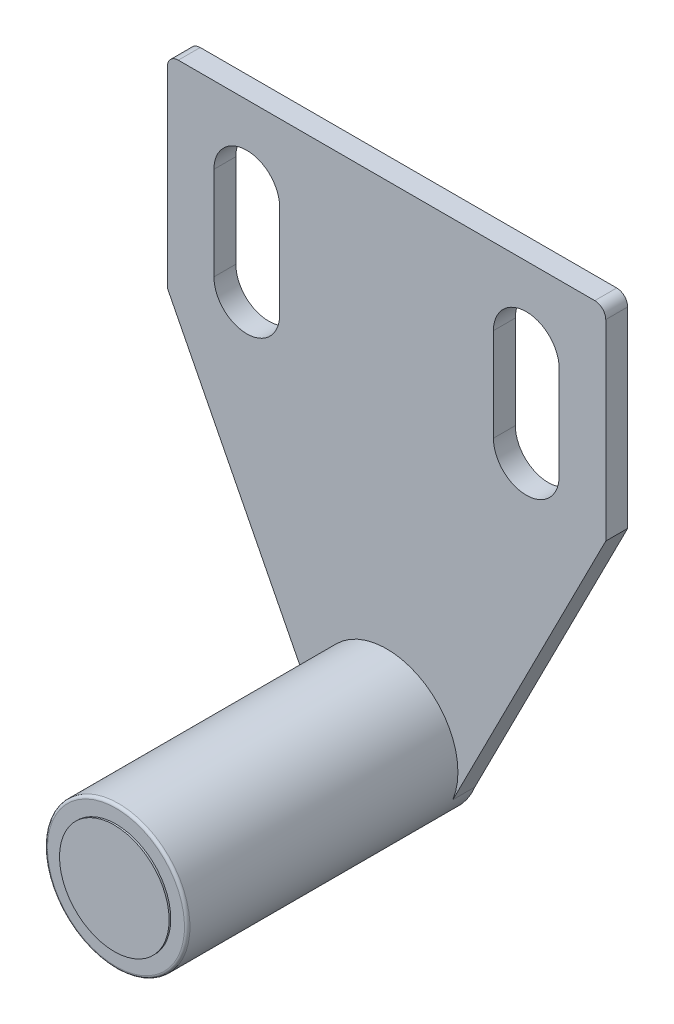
ISO-10303-21;
HEADER;
FILE_DESCRIPTION(('STEP AP214'),'2;1');
FILE_NAME('part.step','',(''),(''),'','','');
FILE_SCHEMA(('AUTOMOTIVE_DESIGN { 1 0 10303 214 1 1 1 1 }'));
ENDSEC;
DATA;
#1=APPLICATION_CONTEXT('core data for automotive mechanical design processes');
#2=APPLICATION_PROTOCOL_DEFINITION('international standard','automotive_design',2000,#1);
#3=PRODUCT_CONTEXT('',#1,'mechanical');
#4=PRODUCT('Part','Part','',(#3));
#5=PRODUCT_RELATED_PRODUCT_CATEGORY('part','',(#4));
#6=PRODUCT_DEFINITION_FORMATION('','',#4);
#7=PRODUCT_DEFINITION_CONTEXT('part definition',#1,'design');
#8=PRODUCT_DEFINITION('design','',#6,#7);
#9=PRODUCT_DEFINITION_SHAPE('','',#8);
#10=(LENGTH_UNIT() NAMED_UNIT(*) SI_UNIT(.MILLI.,.METRE.));
#11=(NAMED_UNIT(*) PLANE_ANGLE_UNIT() SI_UNIT($,.RADIAN.));
#12=(NAMED_UNIT(*) SI_UNIT($,.STERADIAN.) SOLID_ANGLE_UNIT());
#13=UNCERTAINTY_MEASURE_WITH_UNIT(LENGTH_MEASURE(1.E-05),#10,'distance_accuracy_value','');
#14=(GEOMETRIC_REPRESENTATION_CONTEXT(3) GLOBAL_UNCERTAINTY_ASSIGNED_CONTEXT((#13)) GLOBAL_UNIT_ASSIGNED_CONTEXT((#10,
#11,#12)) REPRESENTATION_CONTEXT('',''));
#15=CARTESIAN_POINT('',(0.,0.,0.));
#16=DIRECTION('',(0.,0.,1.));
#17=DIRECTION('',(1.,0.,0.));
#18=AXIS2_PLACEMENT_3D('',#15,#16,#17);
#19=CARTESIAN_POINT('',(0.0120447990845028,-28.5056632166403,26.45));
#20=DIRECTION('',(0.,0.,1.));
#21=DIRECTION('',(1.,0.,0.));
#22=AXIS2_PLACEMENT_3D('',#19,#20,#21);
#23=TOROIDAL_SURFACE('',#22,6.25,0.25);
#24=CARTESIAN_POINT('',(0.0120447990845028,-28.5056632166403,26.7));
#25=DIRECTION('',(0.,0.,-1.));
#26=DIRECTION('',(0.891317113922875,0.453380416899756,0.));
#27=AXIS2_PLACEMENT_3D('',#24,#25,#26);
#28=CIRCLE('',#27,6.25);
#29=CARTESIAN_POINT('',(-5.55868716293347,-31.3392908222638,26.7));
#30=VERTEX_POINT('',#29);
#31=CARTESIAN_POINT('',(-6.2379552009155,-28.5056632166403,26.7));
#32=VERTEX_POINT('',#31);
#33=EDGE_CURVE('E10',#30,#32,#28,.T.);
#34=ORIENTED_EDGE('',*,*,#33,.T.);
#35=CARTESIAN_POINT('',(-6.2379552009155,-28.5056632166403,26.45));
#36=DIRECTION('',(0.,-1.,0.));
#37=DIRECTION('',(-1.,0.,0.));
#38=AXIS2_PLACEMENT_3D('',#35,#36,#37);
#39=CIRCLE('',#38,0.25);
#40=CARTESIAN_POINT('',(-6.4879552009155,-28.5056632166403,26.45));
#41=VERTEX_POINT('',#40);
#42=EDGE_CURVE('E27',#32,#41,#39,.T.);
#43=ORIENTED_EDGE('',*,*,#42,.T.);
#44=CARTESIAN_POINT('',(0.0120447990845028,-28.5056632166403,26.45));
#45=DIRECTION('',(0.,0.,1.));
#46=DIRECTION('',(0.891317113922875,0.453380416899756,0.));
#47=AXIS2_PLACEMENT_3D('',#44,#45,#46);
#48=CIRCLE('',#47,6.5);
#49=CARTESIAN_POINT('',(-5.78151644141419,-31.4526359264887,26.45));
#50=VERTEX_POINT('',#49);
#51=EDGE_CURVE('E300',#41,#50,#48,.T.);
#52=ORIENTED_EDGE('',*,*,#51,.T.);
#53=CARTESIAN_POINT('',(0.0120447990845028,-28.5056632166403,26.45));
#54=DIRECTION('',(0.,0.,1.));
#55=DIRECTION('',(0.891317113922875,0.453380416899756,0.));
#56=AXIS2_PLACEMENT_3D('',#53,#54,#55);
#57=CIRCLE('',#56,6.5);
#58=EDGE_CURVE('E275',#50,#41,#57,.T.);
#59=ORIENTED_EDGE('',*,*,#58,.T.);
#60=ORIENTED_EDGE('',*,*,#42,.F.);
#61=CARTESIAN_POINT('',(0.0120447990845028,-28.5056632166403,26.7));
#62=DIRECTION('',(0.,0.,-1.));
#63=DIRECTION('',(0.891317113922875,0.453380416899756,0.));
#64=AXIS2_PLACEMENT_3D('',#61,#62,#63);
#65=CIRCLE('',#64,6.25);
#66=EDGE_CURVE('E246',#32,#30,#65,.T.);
#67=ORIENTED_EDGE('',*,*,#66,.T.);
#68=EDGE_LOOP('',(#34,#43,#52,#59,#60,#67));
#69=FACE_BOUND('',#68,.T.);
#70=ADVANCED_FACE('F16',(#69),#23,.T.);
#71=CARTESIAN_POINT('',(0.012044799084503,-28.5056632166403,26.7));
#72=DIRECTION('',(0.,0.,1.));
#73=DIRECTION('',(1.,0.,0.));
#74=AXIS2_PLACEMENT_3D('',#71,#72,#73);
#75=PLANE('',#74);
#76=ORIENTED_EDGE('',*,*,#33,.F.);
#77=ORIENTED_EDGE('',*,*,#66,.F.);
#78=EDGE_LOOP('',(#76,#77));
#79=FACE_BOUND('',#78,.T.);
#80=CARTESIAN_POINT('',(0.0120447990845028,-28.5056632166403,26.7));
#81=DIRECTION('',(0.,0.,-1.));
#82=DIRECTION('',(1.,0.,0.));
#83=AXIS2_PLACEMENT_3D('',#80,#81,#82);
#84=CIRCLE('',#83,5.);
#85=CARTESIAN_POINT('',(5.0120447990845,-28.5056632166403,26.7));
#86=VERTEX_POINT('',#85);
#87=CARTESIAN_POINT('',(-4.9879552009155,-28.5056632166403,26.7));
#88=VERTEX_POINT('',#87);
#89=EDGE_CURVE('E243',#86,#88,#84,.T.);
#90=ORIENTED_EDGE('',*,*,#89,.T.);
#91=CARTESIAN_POINT('',(0.0120447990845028,-28.5056632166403,26.7));
#92=DIRECTION('',(0.,0.,-1.));
#93=DIRECTION('',(1.,0.,0.));
#94=AXIS2_PLACEMENT_3D('',#91,#92,#93);
#95=CIRCLE('',#94,5.);
#96=EDGE_CURVE('E247',#88,#86,#95,.T.);
#97=ORIENTED_EDGE('',*,*,#96,.T.);
#98=EDGE_LOOP('',(#90,#97));
#99=FACE_BOUND('',#98,.T.);
#100=ADVANCED_FACE('F701',(#79,#99),#75,.T.);
#101=CARTESIAN_POINT('',(0.0120447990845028,-28.5056632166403,0.));
#102=DIRECTION('',(0.,0.,1.));
#103=DIRECTION('',(0.891317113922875,0.453380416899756,0.));
#104=AXIS2_PLACEMENT_3D('',#101,#102,#103);
#105=CYLINDRICAL_SURFACE('',#104,6.5);
#106=ORIENTED_EDGE('',*,*,#58,.F.);
#107=DIRECTION('',(0.,0.,-1.));
#108=VECTOR('',#107,1.);
#109=CARTESIAN_POINT('',(-5.78151644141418,-31.4526359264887,0.));
#110=LINE('',#109,#108);
#111=CARTESIAN_POINT('',(-5.78151644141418,-31.4526359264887,2.));
#112=VERTEX_POINT('',#111);
#113=EDGE_CURVE('E310',#50,#112,#110,.T.);
#114=ORIENTED_EDGE('',*,*,#113,.T.);
#115=DIRECTION('',(0.,0.,1.));
#116=VECTOR('',#115,1.);
#117=CARTESIAN_POINT('',(-5.78151644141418,-31.4526359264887,0.));
#118=LINE('',#117,#116);
#119=CARTESIAN_POINT('',(-5.78151644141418,-31.4526359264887,0.));
#120=VERTEX_POINT('',#119);
#121=EDGE_CURVE('E268',#120,#112,#118,.T.);
#122=ORIENTED_EDGE('',*,*,#121,.F.);
#123=CARTESIAN_POINT('',(0.0120447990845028,-28.5056632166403,0.));
#124=DIRECTION('',(0.,0.,-1.));
#125=DIRECTION('',(0.891317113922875,0.453380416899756,0.));
#126=AXIS2_PLACEMENT_3D('',#123,#124,#125);
#127=CIRCLE('',#126,6.5);
#128=CARTESIAN_POINT('',(6.04810799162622,-30.9172894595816,0.));
#129=VERTEX_POINT('',#128);
#130=EDGE_CURVE('E286',#129,#120,#127,.T.);
#131=ORIENTED_EDGE('',*,*,#130,.F.);
#132=DIRECTION('',(0.,0.,1.));
#133=VECTOR('',#132,1.);
#134=CARTESIAN_POINT('',(6.04810799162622,-30.9172894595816,0.));
#135=LINE('',#134,#133);
#136=CARTESIAN_POINT('',(6.04810799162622,-30.9172894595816,2.));
#137=VERTEX_POINT('',#136);
#138=EDGE_CURVE('E263',#129,#137,#135,.T.);
#139=ORIENTED_EDGE('',*,*,#138,.T.);
#140=CARTESIAN_POINT('',(0.0120447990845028,-28.5056632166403,2.));
#141=DIRECTION('',(0.,0.,-1.));
#142=DIRECTION('',(-0.891317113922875,-0.453380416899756,0.));
#143=AXIS2_PLACEMENT_3D('',#140,#141,#142);
#144=CIRCLE('',#143,6.5);
#145=EDGE_CURVE('E281',#112,#137,#144,.T.);
#146=ORIENTED_EDGE('',*,*,#145,.F.);
#147=ORIENTED_EDGE('',*,*,#113,.F.);
#148=ORIENTED_EDGE('',*,*,#51,.F.);
#149=EDGE_LOOP('',(#106,#114,#122,#131,#139,#146,#147,#148));
#150=FACE_BOUND('',#149,.T.);
#151=ADVANCED_FACE('F642',(#150),#105,.T.);
#152=CARTESIAN_POINT('',(0.0120447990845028,-28.5056632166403,26.7));
#153=DIRECTION('',(0.,0.,1.));
#154=DIRECTION('',(1.,0.,0.));
#155=AXIS2_PLACEMENT_3D('',#152,#153,#154);
#156=CYLINDRICAL_SURFACE('',#155,5.);
#157=CARTESIAN_POINT('',(0.0120447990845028,-28.5056632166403,26.85));
#158=DIRECTION('',(0.,0.,1.));
#159=DIRECTION('',(1.,0.,0.));
#160=AXIS2_PLACEMENT_3D('',#157,#158,#159);
#161=CIRCLE('',#160,5.);
#162=CARTESIAN_POINT('',(5.0120447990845,-28.5056632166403,26.85));
#163=VERTEX_POINT('',#162);
#164=CARTESIAN_POINT('',(-4.9879552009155,-28.5056632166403,26.85));
#165=VERTEX_POINT('',#164);
#166=EDGE_CURVE('E264',#163,#165,#161,.T.);
#167=ORIENTED_EDGE('',*,*,#166,.F.);
#168=CARTESIAN_POINT('',(0.0120447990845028,-28.5056632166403,26.85));
#169=DIRECTION('',(0.,0.,1.));
#170=DIRECTION('',(1.,0.,0.));
#171=AXIS2_PLACEMENT_3D('',#168,#169,#170);
#172=CIRCLE('',#171,5.);
#173=EDGE_CURVE('E283',#165,#163,#172,.T.);
#174=ORIENTED_EDGE('',*,*,#173,.F.);
#175=DIRECTION('',(0.,0.,-1.));
#176=VECTOR('',#175,1.);
#177=CARTESIAN_POINT('',(-4.9879552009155,-28.5056632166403,26.7));
#178=LINE('',#177,#176);
#179=EDGE_CURVE('E259',#165,#88,#178,.T.);
#180=ORIENTED_EDGE('',*,*,#179,.T.);
#181=ORIENTED_EDGE('',*,*,#89,.F.);
#182=ORIENTED_EDGE('',*,*,#96,.F.);
#183=ORIENTED_EDGE('',*,*,#179,.F.);
#184=EDGE_LOOP('',(#167,#174,#180,#181,#182,#183));
#185=FACE_BOUND('',#184,.T.);
#186=ADVANCED_FACE('F707',(#185),#156,.T.);
#187=CARTESIAN_POINT('',(0.012044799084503,-28.5056632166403,26.85));
#188=DIRECTION('',(0.,0.,1.));
#189=DIRECTION('',(1.,0.,0.));
#190=AXIS2_PLACEMENT_3D('',#187,#188,#189);
#191=PLANE('',#190);
#192=ORIENTED_EDGE('',*,*,#166,.T.);
#193=ORIENTED_EDGE('',*,*,#173,.T.);
#194=EDGE_LOOP('',(#192,#193));
#195=FACE_BOUND('',#194,.T.);
#196=ADVANCED_FACE('F709',(#195),#191,.T.);
#197=CARTESIAN_POINT('',(-0.000749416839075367,-4.95028168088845,2.));
#198=DIRECTION('',(0.,0.,1.));
#199=DIRECTION('',(1.,0.,0.));
#200=AXIS2_PLACEMENT_3D('',#197,#198,#199);
#201=PLANE('',#200);
#202=ORIENTED_EDGE('',*,*,#145,.T.);
#203=DIRECTION('',(-0.453528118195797,-0.891241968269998,0.));
#204=VECTOR('',#203,1.);
#205=CARTESIAN_POINT('',(20.,-3.5,2.));
#206=LINE('',#205,#204);
#207=CARTESIAN_POINT('',(20.,-3.5,2.));
#208=VERTEX_POINT('',#207);
#209=EDGE_CURVE('E314',#208,#137,#206,.T.);
#210=ORIENTED_EDGE('',*,*,#209,.F.);
#211=DIRECTION('',(0.,-1.,0.));
#212=VECTOR('',#211,1.);
#213=CARTESIAN_POINT('',(20.,15.,2.));
#214=LINE('',#213,#212);
#215=CARTESIAN_POINT('',(20.,14.,2.));
#216=VERTEX_POINT('',#215);
#217=EDGE_CURVE('E304',#216,#208,#214,.T.);
#218=ORIENTED_EDGE('',*,*,#217,.F.);
#219=CARTESIAN_POINT('',(19.,14.,2.));
#220=DIRECTION('',(0.,0.,-1.));
#221=DIRECTION('',(0.707106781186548,0.707106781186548,0.));
#222=AXIS2_PLACEMENT_3D('',#219,#220,#221);
#223=CIRCLE('',#222,1.);
#224=CARTESIAN_POINT('',(19.,15.,2.));
#225=VERTEX_POINT('',#224);
#226=EDGE_CURVE('E373',#225,#216,#223,.T.);
#227=ORIENTED_EDGE('',*,*,#226,.F.);
#228=DIRECTION('',(1.,0.,0.));
#229=VECTOR('',#228,1.);
#230=CARTESIAN_POINT('',(-20.,15.,2.));
#231=LINE('',#230,#229);
#232=CARTESIAN_POINT('',(-19.,15.,2.));
#233=VERTEX_POINT('',#232);
#234=EDGE_CURVE('E265',#233,#225,#231,.T.);
#235=ORIENTED_EDGE('',*,*,#234,.F.);
#236=CARTESIAN_POINT('',(-19.,14.,2.));
#237=DIRECTION('',(0.,0.,-1.));
#238=DIRECTION('',(-0.707106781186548,0.707106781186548,0.));
#239=AXIS2_PLACEMENT_3D('',#236,#237,#238);
#240=CIRCLE('',#239,1.);
#241=CARTESIAN_POINT('',(-20.,14.,2.));
#242=VERTEX_POINT('',#241);
#243=EDGE_CURVE('E253',#242,#233,#240,.T.);
#244=ORIENTED_EDGE('',*,*,#243,.F.);
#245=DIRECTION('',(0.,1.,0.));
#246=VECTOR('',#245,1.);
#247=CARTESIAN_POINT('',(-20.,-3.5,2.));
#248=LINE('',#247,#246);
#249=CARTESIAN_POINT('',(-20.,-3.5,2.));
#250=VERTEX_POINT('',#249);
#251=EDGE_CURVE('E298',#250,#242,#248,.T.);
#252=ORIENTED_EDGE('',*,*,#251,.F.);
#253=DIRECTION('',(-0.453380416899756,0.891317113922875,0.));
#254=VECTOR('',#253,1.);
#255=CARTESIAN_POINT('',(-5.78151644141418,-31.4526359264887,2.));
#256=LINE('',#255,#254);
#257=EDGE_CURVE('E269',#112,#250,#256,.T.);
#258=ORIENTED_EDGE('',*,*,#257,.F.);
#259=EDGE_LOOP('',(#202,#210,#218,#227,#235,#244,#252,#258));
#260=FACE_BOUND('',#259,.T.);
#261=DIRECTION('',(0.,1.,0.));
#262=VECTOR('',#261,1.);
#263=CARTESIAN_POINT('',(9.75,-2.72514084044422,2.));
#264=LINE('',#263,#262);
#265=CARTESIAN_POINT('',(9.75,-0.5,2.));
#266=VERTEX_POINT('',#265);
#267=CARTESIAN_POINT('',(9.75,8.,2.));
#268=VERTEX_POINT('',#267);
#269=EDGE_CURVE('E284',#266,#268,#264,.T.);
#270=ORIENTED_EDGE('',*,*,#269,.T.);
#271=CARTESIAN_POINT('',(12.75,8.,2.));
#272=DIRECTION('',(0.,0.,-1.));
#273=DIRECTION('',(-1.,0.,0.));
#274=AXIS2_PLACEMENT_3D('',#271,#272,#273);
#275=CIRCLE('',#274,3.);
#276=CARTESIAN_POINT('',(15.75,8.,2.));
#277=VERTEX_POINT('',#276);
#278=EDGE_CURVE('E242',#268,#277,#275,.T.);
#279=ORIENTED_EDGE('',*,*,#278,.T.);
#280=DIRECTION('',(0.,-1.,0.));
#281=VECTOR('',#280,1.);
#282=CARTESIAN_POINT('',(15.75,1.52485915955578,2.));
#283=LINE('',#282,#281);
#284=CARTESIAN_POINT('',(15.75,-0.5,2.));
#285=VERTEX_POINT('',#284);
#286=EDGE_CURVE('E238',#277,#285,#283,.T.);
#287=ORIENTED_EDGE('',*,*,#286,.T.);
#288=CARTESIAN_POINT('',(12.75,-0.5,2.));
#289=DIRECTION('',(0.,0.,-1.));
#290=DIRECTION('',(1.,0.,0.));
#291=AXIS2_PLACEMENT_3D('',#288,#289,#290);
#292=CIRCLE('',#291,3.);
#293=EDGE_CURVE('E216',#285,#266,#292,.T.);
#294=ORIENTED_EDGE('',*,*,#293,.T.);
#295=EDGE_LOOP('',(#270,#279,#287,#294));
#296=FACE_BOUND('',#295,.T.);
#297=DIRECTION('',(0.,1.,0.));
#298=VECTOR('',#297,1.);
#299=CARTESIAN_POINT('',(-15.75,-2.72514084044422,2.));
#300=LINE('',#299,#298);
#301=CARTESIAN_POINT('',(-15.75,-0.5,2.));
#302=VERTEX_POINT('',#301);
#303=CARTESIAN_POINT('',(-15.75,8.,2.));
#304=VERTEX_POINT('',#303);
#305=EDGE_CURVE('E206',#302,#304,#300,.T.);
#306=ORIENTED_EDGE('',*,*,#305,.T.);
#307=CARTESIAN_POINT('',(-12.75,8.,2.));
#308=DIRECTION('',(0.,0.,-1.));
#309=DIRECTION('',(-1.,0.,0.));
#310=AXIS2_PLACEMENT_3D('',#307,#308,#309);
#311=CIRCLE('',#310,3.);
#312=CARTESIAN_POINT('',(-9.75,8.,2.));
#313=VERTEX_POINT('',#312);
#314=EDGE_CURVE('E196',#304,#313,#311,.T.);
#315=ORIENTED_EDGE('',*,*,#314,.T.);
#316=DIRECTION('',(0.,-1.,0.));
#317=VECTOR('',#316,1.);
#318=CARTESIAN_POINT('',(-9.75,1.52485915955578,2.));
#319=LINE('',#318,#317);
#320=CARTESIAN_POINT('',(-9.75,-0.5,2.));
#321=VERTEX_POINT('',#320);
#322=EDGE_CURVE('E207',#313,#321,#319,.T.);
#323=ORIENTED_EDGE('',*,*,#322,.T.);
#324=CARTESIAN_POINT('',(-12.75,-0.5,2.));
#325=DIRECTION('',(0.,0.,-1.));
#326=DIRECTION('',(1.,0.,0.));
#327=AXIS2_PLACEMENT_3D('',#324,#325,#326);
#328=CIRCLE('',#327,3.);
#329=EDGE_CURVE('E211',#321,#302,#328,.T.);
#330=ORIENTED_EDGE('',*,*,#329,.T.);
#331=EDGE_LOOP('',(#306,#315,#323,#330));
#332=FACE_BOUND('',#331,.T.);
#333=ADVANCED_FACE('F210',(#260,#296,#332),#201,.T.);
#334=CARTESIAN_POINT('',(-19.,14.,0.));
#335=DIRECTION('',(0.,0.,1.));
#336=DIRECTION('',(-0.707106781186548,0.707106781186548,0.));
#337=AXIS2_PLACEMENT_3D('',#334,#335,#336);
#338=CYLINDRICAL_SURFACE('',#337,1.);
#339=ORIENTED_EDGE('',*,*,#243,.T.);
#340=DIRECTION('',(0.,0.,-1.));
#341=VECTOR('',#340,1.);
#342=CARTESIAN_POINT('',(-19.,15.,0.));
#343=LINE('',#342,#341);
#344=CARTESIAN_POINT('',(-19.,15.,0.));
#345=VERTEX_POINT('',#344);
#346=EDGE_CURVE('E249',#233,#345,#343,.T.);
#347=ORIENTED_EDGE('',*,*,#346,.T.);
#348=CARTESIAN_POINT('',(-19.,14.,0.));
#349=DIRECTION('',(0.,0.,1.));
#350=DIRECTION('',(-0.707106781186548,0.707106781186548,0.));
#351=AXIS2_PLACEMENT_3D('',#348,#349,#350);
#352=CIRCLE('',#351,1.);
#353=CARTESIAN_POINT('',(-20.,14.,0.));
#354=VERTEX_POINT('',#353);
#355=EDGE_CURVE('E254',#345,#354,#352,.T.);
#356=ORIENTED_EDGE('',*,*,#355,.T.);
#357=DIRECTION('',(0.,0.,1.));
#358=VECTOR('',#357,1.);
#359=CARTESIAN_POINT('',(-20.,14.,0.));
#360=LINE('',#359,#358);
#361=EDGE_CURVE('E255',#354,#242,#360,.T.);
#362=ORIENTED_EDGE('',*,*,#361,.T.);
#363=EDGE_LOOP('',(#339,#347,#356,#362));
#364=FACE_BOUND('',#363,.T.);
#365=ADVANCED_FACE('F717',(#364),#338,.T.);
#366=CARTESIAN_POINT('',(-20.,-3.5,0.));
#367=DIRECTION('',(-1.,0.,0.));
#368=DIRECTION('',(0.,1.,0.));
#369=AXIS2_PLACEMENT_3D('',#366,#367,#368);
#370=PLANE('',#369);
#371=ORIENTED_EDGE('',*,*,#361,.F.);
#372=DIRECTION('',(0.,1.,0.));
#373=VECTOR('',#372,1.);
#374=CARTESIAN_POINT('',(-20.,-3.5,0.));
#375=LINE('',#374,#373);
#376=CARTESIAN_POINT('',(-20.,-3.5,0.));
#377=VERTEX_POINT('',#376);
#378=EDGE_CURVE('E357',#377,#354,#375,.T.);
#379=ORIENTED_EDGE('',*,*,#378,.F.);
#380=DIRECTION('',(0.,0.,1.));
#381=VECTOR('',#380,1.);
#382=CARTESIAN_POINT('',(-20.,-3.5,0.));
#383=LINE('',#382,#381);
#384=EDGE_CURVE('E20',#377,#250,#383,.T.);
#385=ORIENTED_EDGE('',*,*,#384,.T.);
#386=ORIENTED_EDGE('',*,*,#251,.T.);
#387=EDGE_LOOP('',(#371,#379,#385,#386));
#388=FACE_BOUND('',#387,.T.);
#389=ADVANCED_FACE('F746',(#388),#370,.T.);
#390=CARTESIAN_POINT('',(-0.000749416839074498,-4.95028168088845,0.));
#391=DIRECTION('',(0.,0.,1.));
#392=DIRECTION('',(1.,0.,0.));
#393=AXIS2_PLACEMENT_3D('',#390,#391,#392);
#394=PLANE('',#393);
#395=ORIENTED_EDGE('',*,*,#355,.F.);
#396=DIRECTION('',(1.,0.,0.));
#397=VECTOR('',#396,1.);
#398=CARTESIAN_POINT('',(-20.,15.,0.));
#399=LINE('',#398,#397);
#400=CARTESIAN_POINT('',(19.,15.,0.));
#401=VERTEX_POINT('',#400);
#402=EDGE_CURVE('E294',#345,#401,#399,.T.);
#403=ORIENTED_EDGE('',*,*,#402,.T.);
#404=CARTESIAN_POINT('',(19.,14.,0.));
#405=DIRECTION('',(0.,0.,1.));
#406=DIRECTION('',(0.707106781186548,0.707106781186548,0.));
#407=AXIS2_PLACEMENT_3D('',#404,#405,#406);
#408=CIRCLE('',#407,1.);
#409=CARTESIAN_POINT('',(20.,14.,0.));
#410=VERTEX_POINT('',#409);
#411=EDGE_CURVE('E366',#410,#401,#408,.T.);
#412=ORIENTED_EDGE('',*,*,#411,.F.);
#413=DIRECTION('',(0.,-1.,0.));
#414=VECTOR('',#413,1.);
#415=CARTESIAN_POINT('',(20.,15.,0.));
#416=LINE('',#415,#414);
#417=CARTESIAN_POINT('',(20.,-3.5,0.));
#418=VERTEX_POINT('',#417);
#419=EDGE_CURVE('E299',#410,#418,#416,.T.);
#420=ORIENTED_EDGE('',*,*,#419,.T.);
#421=DIRECTION('',(-0.453528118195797,-0.891241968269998,0.));
#422=VECTOR('',#421,1.);
#423=CARTESIAN_POINT('',(20.,-3.5,0.));
#424=LINE('',#423,#422);
#425=EDGE_CURVE('E290',#418,#129,#424,.T.);
#426=ORIENTED_EDGE('',*,*,#425,.T.);
#427=ORIENTED_EDGE('',*,*,#130,.T.);
#428=DIRECTION('',(-0.453380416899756,0.891317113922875,0.));
#429=VECTOR('',#428,1.);
#430=CARTESIAN_POINT('',(-5.78151644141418,-31.4526359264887,0.));
#431=LINE('',#430,#429);
#432=EDGE_CURVE('E291',#120,#377,#431,.T.);
#433=ORIENTED_EDGE('',*,*,#432,.T.);
#434=ORIENTED_EDGE('',*,*,#378,.T.);
#435=EDGE_LOOP('',(#395,#403,#412,#420,#426,#427,#433,#434));
#436=FACE_BOUND('',#435,.T.);
#437=DIRECTION('',(0.,-1.,0.));
#438=VECTOR('',#437,1.);
#439=CARTESIAN_POINT('',(-15.75,-2.72514084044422,0.));
#440=LINE('',#439,#438);
#441=CARTESIAN_POINT('',(-15.75,8.,0.));
#442=VERTEX_POINT('',#441);
#443=CARTESIAN_POINT('',(-15.75,-0.5,0.));
#444=VERTEX_POINT('',#443);
#445=EDGE_CURVE('E221',#442,#444,#440,.T.);
#446=ORIENTED_EDGE('',*,*,#445,.T.);
#447=CARTESIAN_POINT('',(-12.75,-0.5,0.));
#448=DIRECTION('',(0.,0.,1.));
#449=DIRECTION('',(1.,0.,0.));
#450=AXIS2_PLACEMENT_3D('',#447,#448,#449);
#451=CIRCLE('',#450,3.);
#452=CARTESIAN_POINT('',(-9.75,-0.5,0.));
#453=VERTEX_POINT('',#452);
#454=EDGE_CURVE('E358',#444,#453,#451,.T.);
#455=ORIENTED_EDGE('',*,*,#454,.T.);
#456=DIRECTION('',(0.,1.,0.));
#457=VECTOR('',#456,1.);
#458=CARTESIAN_POINT('',(-9.75,1.52485915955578,0.));
#459=LINE('',#458,#457);
#460=CARTESIAN_POINT('',(-9.75,8.,0.));
#461=VERTEX_POINT('',#460);
#462=EDGE_CURVE('E359',#453,#461,#459,.T.);
#463=ORIENTED_EDGE('',*,*,#462,.T.);
#464=CARTESIAN_POINT('',(-12.75,8.,0.));
#465=DIRECTION('',(0.,0.,1.));
#466=DIRECTION('',(-1.,0.,0.));
#467=AXIS2_PLACEMENT_3D('',#464,#465,#466);
#468=CIRCLE('',#467,3.);
#469=EDGE_CURVE('E236',#461,#442,#468,.T.);
#470=ORIENTED_EDGE('',*,*,#469,.T.);
#471=EDGE_LOOP('',(#446,#455,#463,#470));
#472=FACE_BOUND('',#471,.T.);
#473=DIRECTION('',(0.,-1.,0.));
#474=VECTOR('',#473,1.);
#475=CARTESIAN_POINT('',(9.75,-2.72514084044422,0.));
#476=LINE('',#475,#474);
#477=CARTESIAN_POINT('',(9.75,8.,0.));
#478=VERTEX_POINT('',#477);
#479=CARTESIAN_POINT('',(9.75,-0.5,0.));
#480=VERTEX_POINT('',#479);
#481=EDGE_CURVE('E276',#478,#480,#476,.T.);
#482=ORIENTED_EDGE('',*,*,#481,.T.);
#483=CARTESIAN_POINT('',(12.75,-0.5,0.));
#484=DIRECTION('',(0.,0.,1.));
#485=DIRECTION('',(1.,0.,0.));
#486=AXIS2_PLACEMENT_3D('',#483,#484,#485);
#487=CIRCLE('',#486,3.);
#488=CARTESIAN_POINT('',(15.75,-0.5,0.));
#489=VERTEX_POINT('',#488);
#490=EDGE_CURVE('E280',#480,#489,#487,.T.);
#491=ORIENTED_EDGE('',*,*,#490,.T.);
#492=DIRECTION('',(0.,1.,0.));
#493=VECTOR('',#492,1.);
#494=CARTESIAN_POINT('',(15.75,1.52485915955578,0.));
#495=LINE('',#494,#493);
#496=CARTESIAN_POINT('',(15.75,8.,0.));
#497=VERTEX_POINT('',#496);
#498=EDGE_CURVE('E345',#489,#497,#495,.T.);
#499=ORIENTED_EDGE('',*,*,#498,.T.);
#500=CARTESIAN_POINT('',(12.75,8.,0.));
#501=DIRECTION('',(0.,0.,1.));
#502=DIRECTION('',(-1.,0.,0.));
#503=AXIS2_PLACEMENT_3D('',#500,#501,#502);
#504=CIRCLE('',#503,3.);
#505=EDGE_CURVE('E349',#497,#478,#504,.T.);
#506=ORIENTED_EDGE('',*,*,#505,.T.);
#507=EDGE_LOOP('',(#482,#491,#499,#506));
#508=FACE_BOUND('',#507,.T.);
#509=ADVANCED_FACE('F402',(#436,#472,#508),#394,.F.);
#510=CARTESIAN_POINT('',(19.,14.,0.));
#511=DIRECTION('',(0.,0.,1.));
#512=DIRECTION('',(0.707106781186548,0.707106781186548,0.));
#513=AXIS2_PLACEMENT_3D('',#510,#511,#512);
#514=CYLINDRICAL_SURFACE('',#513,1.);
#515=ORIENTED_EDGE('',*,*,#226,.T.);
#516=DIRECTION('',(0.,0.,-1.));
#517=VECTOR('',#516,1.);
#518=CARTESIAN_POINT('',(20.,14.,0.));
#519=LINE('',#518,#517);
#520=EDGE_CURVE('E377',#216,#410,#519,.T.);
#521=ORIENTED_EDGE('',*,*,#520,.T.);
#522=ORIENTED_EDGE('',*,*,#411,.T.);
#523=DIRECTION('',(0.,0.,1.));
#524=VECTOR('',#523,1.);
#525=CARTESIAN_POINT('',(19.,15.,0.));
#526=LINE('',#525,#524);
#527=EDGE_CURVE('E308',#401,#225,#526,.T.);
#528=ORIENTED_EDGE('',*,*,#527,.T.);
#529=EDGE_LOOP('',(#515,#521,#522,#528));
#530=FACE_BOUND('',#529,.T.);
#531=ADVANCED_FACE('F736',(#530),#514,.T.);
#532=CARTESIAN_POINT('',(20.,15.,0.));
#533=DIRECTION('',(1.,0.,0.));
#534=DIRECTION('',(0.,1.,0.));
#535=AXIS2_PLACEMENT_3D('',#532,#533,#534);
#536=PLANE('',#535);
#537=ORIENTED_EDGE('',*,*,#520,.F.);
#538=ORIENTED_EDGE('',*,*,#217,.T.);
#539=DIRECTION('',(0.,0.,1.));
#540=VECTOR('',#539,1.);
#541=CARTESIAN_POINT('',(20.,-3.5,0.));
#542=LINE('',#541,#540);
#543=EDGE_CURVE('E272',#418,#208,#542,.T.);
#544=ORIENTED_EDGE('',*,*,#543,.F.);
#545=ORIENTED_EDGE('',*,*,#419,.F.);
#546=EDGE_LOOP('',(#537,#538,#544,#545));
#547=FACE_BOUND('',#546,.T.);
#548=ADVANCED_FACE('F738',(#547),#536,.T.);
#549=CARTESIAN_POINT('',(-15.75,-0.5,2.));
#550=DIRECTION('',(-1.,0.,0.));
#551=DIRECTION('',(0.,1.,0.));
#552=AXIS2_PLACEMENT_3D('',#549,#550,#551);
#553=PLANE('',#552);
#554=ORIENTED_EDGE('',*,*,#305,.F.);
#555=DIRECTION('',(0.,0.,-1.));
#556=VECTOR('',#555,1.);
#557=CARTESIAN_POINT('',(-15.75,-0.5,2.));
#558=LINE('',#557,#556);
#559=EDGE_CURVE('E309',#302,#444,#558,.T.);
#560=ORIENTED_EDGE('',*,*,#559,.T.);
#561=ORIENTED_EDGE('',*,*,#445,.F.);
#562=DIRECTION('',(0.,0.,-1.));
#563=VECTOR('',#562,1.);
#564=CARTESIAN_POINT('',(-15.75,8.,2.));
#565=LINE('',#564,#563);
#566=EDGE_CURVE('E200',#304,#442,#565,.T.);
#567=ORIENTED_EDGE('',*,*,#566,.F.);
#568=EDGE_LOOP('',(#554,#560,#561,#567));
#569=FACE_BOUND('',#568,.T.);
#570=ADVANCED_FACE('F219',(#569),#553,.F.);
#571=CARTESIAN_POINT('',(-12.75,-0.5,2.));
#572=DIRECTION('',(0.,0.,-1.));
#573=DIRECTION('',(1.,0.,0.));
#574=AXIS2_PLACEMENT_3D('',#571,#572,#573);
#575=CYLINDRICAL_SURFACE('',#574,3.);
#576=ORIENTED_EDGE('',*,*,#329,.F.);
#577=DIRECTION('',(0.,0.,-1.));
#578=VECTOR('',#577,1.);
#579=CARTESIAN_POINT('',(-9.75,-0.5,2.));
#580=LINE('',#579,#578);
#581=EDGE_CURVE('E229',#321,#453,#580,.T.);
#582=ORIENTED_EDGE('',*,*,#581,.T.);
#583=ORIENTED_EDGE('',*,*,#454,.F.);
#584=ORIENTED_EDGE('',*,*,#559,.F.);
#585=EDGE_LOOP('',(#576,#582,#583,#584));
#586=FACE_BOUND('',#585,.T.);
#587=ADVANCED_FACE('F780',(#586),#575,.F.);
#588=CARTESIAN_POINT('',(-9.75,8.,2.));
#589=DIRECTION('',(1.,0.,0.));
#590=DIRECTION('',(0.,1.,0.));
#591=AXIS2_PLACEMENT_3D('',#588,#589,#590);
#592=PLANE('',#591);
#593=ORIENTED_EDGE('',*,*,#322,.F.);
#594=DIRECTION('',(0.,0.,-1.));
#595=VECTOR('',#594,1.);
#596=CARTESIAN_POINT('',(-9.75,8.,2.));
#597=LINE('',#596,#595);
#598=EDGE_CURVE('E202',#313,#461,#597,.T.);
#599=ORIENTED_EDGE('',*,*,#598,.T.);
#600=ORIENTED_EDGE('',*,*,#462,.F.);
#601=ORIENTED_EDGE('',*,*,#581,.F.);
#602=EDGE_LOOP('',(#593,#599,#600,#601));
#603=FACE_BOUND('',#602,.T.);
#604=ADVANCED_FACE('F732',(#603),#592,.F.);
#605=CARTESIAN_POINT('',(-12.75,8.,2.));
#606=DIRECTION('',(0.,0.,-1.));
#607=DIRECTION('',(-1.,0.,0.));
#608=AXIS2_PLACEMENT_3D('',#605,#606,#607);
#609=CYLINDRICAL_SURFACE('',#608,3.);
#610=ORIENTED_EDGE('',*,*,#314,.F.);
#611=ORIENTED_EDGE('',*,*,#566,.T.);
#612=ORIENTED_EDGE('',*,*,#469,.F.);
#613=ORIENTED_EDGE('',*,*,#598,.F.);
#614=EDGE_LOOP('',(#610,#611,#612,#613));
#615=FACE_BOUND('',#614,.T.);
#616=ADVANCED_FACE('F198',(#615),#609,.F.);
#617=CARTESIAN_POINT('',(9.75,-0.5,2.));
#618=DIRECTION('',(-1.,0.,0.));
#619=DIRECTION('',(0.,1.,0.));
#620=AXIS2_PLACEMENT_3D('',#617,#618,#619);
#621=PLANE('',#620);
#622=ORIENTED_EDGE('',*,*,#269,.F.);
#623=DIRECTION('',(0.,0.,-1.));
#624=VECTOR('',#623,1.);
#625=CARTESIAN_POINT('',(9.75,-0.5,2.));
#626=LINE('',#625,#624);
#627=EDGE_CURVE('E223',#266,#480,#626,.T.);
#628=ORIENTED_EDGE('',*,*,#627,.T.);
#629=ORIENTED_EDGE('',*,*,#481,.F.);
#630=DIRECTION('',(0.,0.,-1.));
#631=VECTOR('',#630,1.);
#632=CARTESIAN_POINT('',(9.75,8.,2.));
#633=LINE('',#632,#631);
#634=EDGE_CURVE('E317',#268,#478,#633,.T.);
#635=ORIENTED_EDGE('',*,*,#634,.F.);
#636=EDGE_LOOP('',(#622,#628,#629,#635));
#637=FACE_BOUND('',#636,.T.);
#638=ADVANCED_FACE('F406',(#637),#621,.F.);
#639=CARTESIAN_POINT('',(12.75,-0.5,2.));
#640=DIRECTION('',(0.,0.,-1.));
#641=DIRECTION('',(1.,0.,0.));
#642=AXIS2_PLACEMENT_3D('',#639,#640,#641);
#643=CYLINDRICAL_SURFACE('',#642,3.);
#644=ORIENTED_EDGE('',*,*,#293,.F.);
#645=DIRECTION('',(0.,0.,-1.));
#646=VECTOR('',#645,1.);
#647=CARTESIAN_POINT('',(15.75,-0.5,2.));
#648=LINE('',#647,#646);
#649=EDGE_CURVE('E232',#285,#489,#648,.T.);
#650=ORIENTED_EDGE('',*,*,#649,.T.);
#651=ORIENTED_EDGE('',*,*,#490,.F.);
#652=ORIENTED_EDGE('',*,*,#627,.F.);
#653=EDGE_LOOP('',(#644,#650,#651,#652));
#654=FACE_BOUND('',#653,.T.);
#655=ADVANCED_FACE('F409',(#654),#643,.F.);
#656=CARTESIAN_POINT('',(15.75,8.,2.));
#657=DIRECTION('',(1.,0.,0.));
#658=DIRECTION('',(0.,0.,1.));
#659=AXIS2_PLACEMENT_3D('',#656,#657,#658);
#660=PLANE('',#659);
#661=ORIENTED_EDGE('',*,*,#286,.F.);
#662=DIRECTION('',(0.,0.,-1.));
#663=VECTOR('',#662,1.);
#664=CARTESIAN_POINT('',(15.75,8.,2.));
#665=LINE('',#664,#663);
#666=EDGE_CURVE('E320',#277,#497,#665,.T.);
#667=ORIENTED_EDGE('',*,*,#666,.T.);
#668=ORIENTED_EDGE('',*,*,#498,.F.);
#669=ORIENTED_EDGE('',*,*,#649,.F.);
#670=EDGE_LOOP('',(#661,#667,#668,#669));
#671=FACE_BOUND('',#670,.T.);
#672=ADVANCED_FACE('F735',(#671),#660,.F.);
#673=CARTESIAN_POINT('',(12.75,8.,2.));
#674=DIRECTION('',(0.,0.,-1.));
#675=DIRECTION('',(-1.,0.,0.));
#676=AXIS2_PLACEMENT_3D('',#673,#674,#675);
#677=CYLINDRICAL_SURFACE('',#676,3.);
#678=ORIENTED_EDGE('',*,*,#278,.F.);
#679=ORIENTED_EDGE('',*,*,#634,.T.);
#680=ORIENTED_EDGE('',*,*,#505,.F.);
#681=ORIENTED_EDGE('',*,*,#666,.F.);
#682=EDGE_LOOP('',(#678,#679,#680,#681));
#683=FACE_BOUND('',#682,.T.);
#684=ADVANCED_FACE('F733',(#683),#677,.F.);
#685=CARTESIAN_POINT('',(20.,-3.5,0.));
#686=DIRECTION('',(0.891241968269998,-0.453528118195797,0.));
#687=DIRECTION('',(0.,0.,-1.));
#688=AXIS2_PLACEMENT_3D('',#685,#686,#687);
#689=PLANE('',#688);
#690=ORIENTED_EDGE('',*,*,#209,.T.);
#691=ORIENTED_EDGE('',*,*,#138,.F.);
#692=ORIENTED_EDGE('',*,*,#425,.F.);
#693=ORIENTED_EDGE('',*,*,#543,.T.);
#694=EDGE_LOOP('',(#690,#691,#692,#693));
#695=FACE_BOUND('',#694,.T.);
#696=ADVANCED_FACE('F18',(#695),#689,.T.);
#697=CARTESIAN_POINT('',(-5.78151644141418,-31.4526359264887,0.));
#698=DIRECTION('',(-0.891317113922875,-0.453380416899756,0.));
#699=DIRECTION('',(-0.453380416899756,0.891317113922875,0.));
#700=AXIS2_PLACEMENT_3D('',#697,#698,#699);
#701=PLANE('',#700);
#702=ORIENTED_EDGE('',*,*,#257,.T.);
#703=ORIENTED_EDGE('',*,*,#384,.F.);
#704=ORIENTED_EDGE('',*,*,#432,.F.);
#705=ORIENTED_EDGE('',*,*,#121,.T.);
#706=EDGE_LOOP('',(#702,#703,#704,#705));
#707=FACE_BOUND('',#706,.T.);
#708=ADVANCED_FACE('F765',(#707),#701,.T.);
#709=CARTESIAN_POINT('',(-20.,15.,0.));
#710=DIRECTION('',(0.,1.,0.));
#711=DIRECTION('',(1.,0.,0.));
#712=AXIS2_PLACEMENT_3D('',#709,#710,#711);
#713=PLANE('',#712);
#714=ORIENTED_EDGE('',*,*,#346,.F.);
#715=ORIENTED_EDGE('',*,*,#234,.T.);
#716=ORIENTED_EDGE('',*,*,#527,.F.);
#717=ORIENTED_EDGE('',*,*,#402,.F.);
#718=EDGE_LOOP('',(#714,#715,#716,#717));
#719=FACE_BOUND('',#718,.T.);
#720=ADVANCED_FACE('F758',(#719),#713,.T.);
#721=CLOSED_SHELL('',(#70,#100,#151,#186,#196,#333,#365,#389,#509,#531,#548,#570,#587,#604,#616,
#638,#655,#672,#684,#696,#708,#720));
#722=MANIFOLD_SOLID_BREP('B1',#721);
#723=ADVANCED_BREP_SHAPE_REPRESENTATION('',(#18,#722),#14);
#724=SHAPE_DEFINITION_REPRESENTATION(#9,#723);
ENDSEC;
END-ISO-10303-21;
